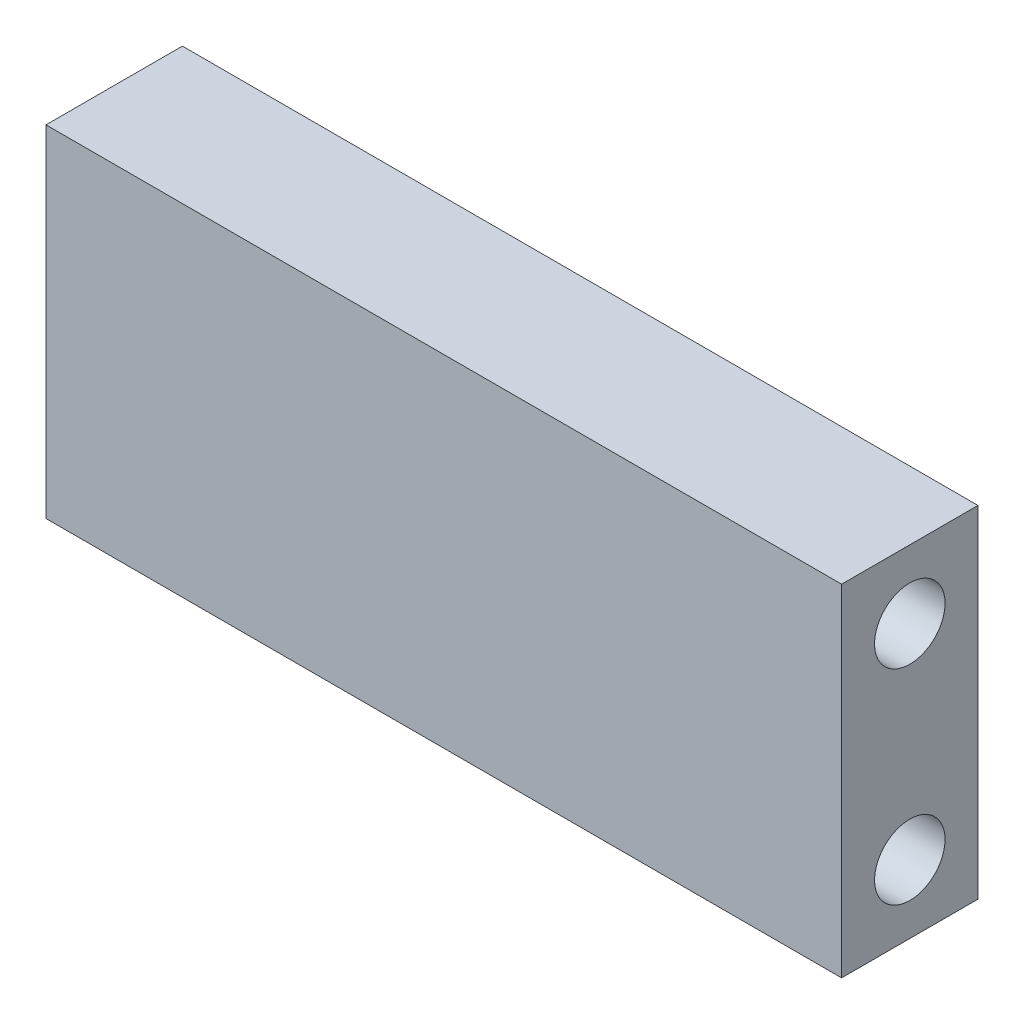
ISO-10303-21;
HEADER;
FILE_DESCRIPTION(('STEP AP214'),'2;1');
FILE_NAME('part.step','',(''),(''),'','','');
FILE_SCHEMA(('AUTOMOTIVE_DESIGN { 1 0 10303 214 1 1 1 1 }'));
ENDSEC;
DATA;
#1=APPLICATION_CONTEXT('core data for automotive mechanical design processes');
#2=APPLICATION_PROTOCOL_DEFINITION('international standard','automotive_design',2000,#1);
#3=PRODUCT_CONTEXT('',#1,'mechanical');
#4=PRODUCT('Part','Part','',(#3));
#5=PRODUCT_RELATED_PRODUCT_CATEGORY('part','',(#4));
#6=PRODUCT_DEFINITION_FORMATION('','',#4);
#7=PRODUCT_DEFINITION_CONTEXT('part definition',#1,'design');
#8=PRODUCT_DEFINITION('design','',#6,#7);
#9=PRODUCT_DEFINITION_SHAPE('','',#8);
#10=(LENGTH_UNIT() NAMED_UNIT(*) SI_UNIT(.MILLI.,.METRE.));
#11=(NAMED_UNIT(*) PLANE_ANGLE_UNIT() SI_UNIT($,.RADIAN.));
#12=(NAMED_UNIT(*) SI_UNIT($,.STERADIAN.) SOLID_ANGLE_UNIT());
#13=UNCERTAINTY_MEASURE_WITH_UNIT(LENGTH_MEASURE(1.E-05),#10,'distance_accuracy_value','');
#14=(GEOMETRIC_REPRESENTATION_CONTEXT(3) GLOBAL_UNCERTAINTY_ASSIGNED_CONTEXT((#13)) GLOBAL_UNIT_ASSIGNED_CONTEXT((#10,
#11,#12)) REPRESENTATION_CONTEXT('',''));
#15=CARTESIAN_POINT('',(0.,0.,0.));
#16=DIRECTION('',(0.,0.,1.));
#17=DIRECTION('',(1.,0.,0.));
#18=AXIS2_PLACEMENT_3D('',#15,#16,#17);
#19=CARTESIAN_POINT('',(0.,0.,0.));
#20=DIRECTION('',(0.,0.,-1.));
#21=DIRECTION('',(0.,-1.,0.));
#22=AXIS2_PLACEMENT_3D('',#19,#20,#21);
#23=PLANE('',#22);
#24=DIRECTION('',(0.,1.,0.));
#25=VECTOR('',#24,1.);
#26=CARTESIAN_POINT('',(35.,-15.,0.));
#27=LINE('',#26,#25);
#28=CARTESIAN_POINT('',(35.,-15.,0.));
#29=VERTEX_POINT('',#28);
#30=CARTESIAN_POINT('',(35.,15.,0.));
#31=VERTEX_POINT('',#30);
#32=EDGE_CURVE('E118',#29,#31,#27,.T.);
#33=ORIENTED_EDGE('',*,*,#32,.F.);
#34=DIRECTION('',(1.,0.,0.));
#35=VECTOR('',#34,1.);
#36=CARTESIAN_POINT('',(-35.,-15.,0.));
#37=LINE('',#36,#35);
#38=CARTESIAN_POINT('',(-35.,-15.,0.));
#39=VERTEX_POINT('',#38);
#40=EDGE_CURVE('E26',#39,#29,#37,.T.);
#41=ORIENTED_EDGE('',*,*,#40,.F.);
#42=DIRECTION('',(0.,-1.,0.));
#43=VECTOR('',#42,1.);
#44=CARTESIAN_POINT('',(-35.,-15.,0.));
#45=LINE('',#44,#43);
#46=CARTESIAN_POINT('',(-35.,15.,0.));
#47=VERTEX_POINT('',#46);
#48=EDGE_CURVE('E71',#47,#39,#45,.T.);
#49=ORIENTED_EDGE('',*,*,#48,.F.);
#50=DIRECTION('',(-1.,0.,0.));
#51=VECTOR('',#50,1.);
#52=CARTESIAN_POINT('',(-35.,15.,0.));
#53=LINE('',#52,#51);
#54=EDGE_CURVE('E74',#31,#47,#53,.T.);
#55=ORIENTED_EDGE('',*,*,#54,.F.);
#56=EDGE_LOOP('',(#33,#41,#49,#55));
#57=FACE_BOUND('',#56,.T.);
#58=ADVANCED_FACE('F17',(#57),#23,.T.);
#59=CARTESIAN_POINT('',(0.,0.,12.));
#60=DIRECTION('',(0.,0.,-1.));
#61=DIRECTION('',(0.,-1.,0.));
#62=AXIS2_PLACEMENT_3D('',#59,#60,#61);
#63=PLANE('',#62);
#64=DIRECTION('',(0.,1.,0.));
#65=VECTOR('',#64,1.);
#66=CARTESIAN_POINT('',(35.,-15.,12.));
#67=LINE('',#66,#65);
#68=CARTESIAN_POINT('',(35.,-15.,12.));
#69=VERTEX_POINT('',#68);
#70=CARTESIAN_POINT('',(35.,15.,12.));
#71=VERTEX_POINT('',#70);
#72=EDGE_CURVE('E102',#69,#71,#67,.T.);
#73=ORIENTED_EDGE('',*,*,#72,.T.);
#74=DIRECTION('',(-1.,0.,0.));
#75=VECTOR('',#74,1.);
#76=CARTESIAN_POINT('',(-35.,15.,12.));
#77=LINE('',#76,#75);
#78=CARTESIAN_POINT('',(-35.,15.,12.));
#79=VERTEX_POINT('',#78);
#80=EDGE_CURVE('E80',#71,#79,#77,.T.);
#81=ORIENTED_EDGE('',*,*,#80,.T.);
#82=DIRECTION('',(0.,-1.,0.));
#83=VECTOR('',#82,1.);
#84=CARTESIAN_POINT('',(-35.,-15.,12.));
#85=LINE('',#84,#83);
#86=CARTESIAN_POINT('',(-35.,-15.,12.));
#87=VERTEX_POINT('',#86);
#88=EDGE_CURVE('E85',#79,#87,#85,.T.);
#89=ORIENTED_EDGE('',*,*,#88,.T.);
#90=DIRECTION('',(1.,0.,0.));
#91=VECTOR('',#90,1.);
#92=CARTESIAN_POINT('',(-35.,-15.,12.));
#93=LINE('',#92,#91);
#94=EDGE_CURVE('E11',#87,#69,#93,.T.);
#95=ORIENTED_EDGE('',*,*,#94,.T.);
#96=EDGE_LOOP('',(#73,#81,#89,#95));
#97=FACE_BOUND('',#96,.T.);
#98=ADVANCED_FACE('F19',(#97),#63,.F.);
#99=CARTESIAN_POINT('',(-35.,-15.,12.));
#100=DIRECTION('',(0.,1.,0.));
#101=DIRECTION('',(1.,0.,0.));
#102=AXIS2_PLACEMENT_3D('',#99,#100,#101);
#103=PLANE('',#102);
#104=ORIENTED_EDGE('',*,*,#40,.T.);
#105=DIRECTION('',(0.,0.,-1.));
#106=VECTOR('',#105,1.);
#107=CARTESIAN_POINT('',(35.,-15.,12.));
#108=LINE('',#107,#106);
#109=EDGE_CURVE('E95',#69,#29,#108,.T.);
#110=ORIENTED_EDGE('',*,*,#109,.F.);
#111=ORIENTED_EDGE('',*,*,#94,.F.);
#112=DIRECTION('',(0.,0.,-1.));
#113=VECTOR('',#112,1.);
#114=CARTESIAN_POINT('',(-35.,-15.,12.));
#115=LINE('',#114,#113);
#116=EDGE_CURVE('E79',#87,#39,#115,.T.);
#117=ORIENTED_EDGE('',*,*,#116,.T.);
#118=EDGE_LOOP('',(#104,#110,#111,#117));
#119=FACE_BOUND('',#118,.T.);
#120=ADVANCED_FACE('F114',(#119),#103,.F.);
#121=CARTESIAN_POINT('',(-35.,-15.,12.));
#122=DIRECTION('',(1.,0.,0.));
#123=DIRECTION('',(0.,1.,0.));
#124=AXIS2_PLACEMENT_3D('',#121,#122,#123);
#125=PLANE('',#124);
#126=CARTESIAN_POINT('',(-35.,-9.,6.));
#127=DIRECTION('',(1.,0.,0.));
#128=DIRECTION('',(0.,0.,-1.));
#129=AXIS2_PLACEMENT_3D('',#126,#127,#128);
#130=CIRCLE('',#129,3.1);
#131=CARTESIAN_POINT('',(-35.,-9.,2.9));
#132=VERTEX_POINT('',#131);
#133=EDGE_CURVE('E129',#132,#132,#130,.T.);
#134=ORIENTED_EDGE('',*,*,#133,.T.);
#135=EDGE_LOOP('',(#134));
#136=FACE_BOUND('',#135,.T.);
#137=CARTESIAN_POINT('',(-35.,9.,6.));
#138=DIRECTION('',(1.,0.,0.));
#139=DIRECTION('',(0.,0.,-1.));
#140=AXIS2_PLACEMENT_3D('',#137,#138,#139);
#141=CIRCLE('',#140,3.1);
#142=CARTESIAN_POINT('',(-35.,9.,2.9));
#143=VERTEX_POINT('',#142);
#144=EDGE_CURVE('E138',#143,#143,#141,.T.);
#145=ORIENTED_EDGE('',*,*,#144,.T.);
#146=EDGE_LOOP('',(#145));
#147=FACE_BOUND('',#146,.T.);
#148=ORIENTED_EDGE('',*,*,#48,.T.);
#149=ORIENTED_EDGE('',*,*,#116,.F.);
#150=ORIENTED_EDGE('',*,*,#88,.F.);
#151=DIRECTION('',(0.,0.,-1.));
#152=VECTOR('',#151,1.);
#153=CARTESIAN_POINT('',(-35.,15.,12.));
#154=LINE('',#153,#152);
#155=EDGE_CURVE('E83',#79,#47,#154,.T.);
#156=ORIENTED_EDGE('',*,*,#155,.T.);
#157=EDGE_LOOP('',(#148,#149,#150,#156));
#158=FACE_BOUND('',#157,.T.);
#159=ADVANCED_FACE('F84',(#136,#147,#158),#125,.F.);
#160=CARTESIAN_POINT('',(-35.,15.,12.));
#161=DIRECTION('',(0.,-1.,0.));
#162=DIRECTION('',(0.,0.,-1.));
#163=AXIS2_PLACEMENT_3D('',#160,#161,#162);
#164=PLANE('',#163);
#165=ORIENTED_EDGE('',*,*,#54,.T.);
#166=ORIENTED_EDGE('',*,*,#155,.F.);
#167=ORIENTED_EDGE('',*,*,#80,.F.);
#168=DIRECTION('',(0.,0.,-1.));
#169=VECTOR('',#168,1.);
#170=CARTESIAN_POINT('',(35.,15.,12.));
#171=LINE('',#170,#169);
#172=EDGE_CURVE('E92',#71,#31,#171,.T.);
#173=ORIENTED_EDGE('',*,*,#172,.T.);
#174=EDGE_LOOP('',(#165,#166,#167,#173));
#175=FACE_BOUND('',#174,.T.);
#176=ADVANCED_FACE('F90',(#175),#164,.F.);
#177=CARTESIAN_POINT('',(35.,-15.,12.));
#178=DIRECTION('',(-1.,0.,0.));
#179=DIRECTION('',(0.,0.,1.));
#180=AXIS2_PLACEMENT_3D('',#177,#178,#179);
#181=PLANE('',#180);
#182=CARTESIAN_POINT('',(35.,-9.,6.));
#183=DIRECTION('',(1.,0.,0.));
#184=DIRECTION('',(0.,0.,-1.));
#185=AXIS2_PLACEMENT_3D('',#182,#183,#184);
#186=CIRCLE('',#185,3.1);
#187=CARTESIAN_POINT('',(35.,-9.,2.9));
#188=VERTEX_POINT('',#187);
#189=EDGE_CURVE('E121',#188,#188,#186,.T.);
#190=ORIENTED_EDGE('',*,*,#189,.F.);
#191=EDGE_LOOP('',(#190));
#192=FACE_BOUND('',#191,.T.);
#193=CARTESIAN_POINT('',(35.,9.,6.));
#194=DIRECTION('',(1.,0.,0.));
#195=DIRECTION('',(0.,0.,-1.));
#196=AXIS2_PLACEMENT_3D('',#193,#194,#195);
#197=CIRCLE('',#196,3.1);
#198=CARTESIAN_POINT('',(35.,9.,2.9));
#199=VERTEX_POINT('',#198);
#200=EDGE_CURVE('E136',#199,#199,#197,.T.);
#201=ORIENTED_EDGE('',*,*,#200,.F.);
#202=EDGE_LOOP('',(#201));
#203=FACE_BOUND('',#202,.T.);
#204=ORIENTED_EDGE('',*,*,#32,.T.);
#205=ORIENTED_EDGE('',*,*,#172,.F.);
#206=ORIENTED_EDGE('',*,*,#72,.F.);
#207=ORIENTED_EDGE('',*,*,#109,.T.);
#208=EDGE_LOOP('',(#204,#205,#206,#207));
#209=FACE_BOUND('',#208,.T.);
#210=ADVANCED_FACE('F117',(#192,#203,#209),#181,.F.);
#211=CARTESIAN_POINT('',(-35.,-9.,6.));
#212=DIRECTION('',(1.,0.,0.));
#213=DIRECTION('',(0.,0.,-1.));
#214=AXIS2_PLACEMENT_3D('',#211,#212,#213);
#215=CYLINDRICAL_SURFACE('',#214,3.1);
#216=ORIENTED_EDGE('',*,*,#189,.T.);
#217=EDGE_LOOP('',(#216));
#218=FACE_BOUND('',#217,.T.);
#219=ORIENTED_EDGE('',*,*,#133,.F.);
#220=EDGE_LOOP('',(#219));
#221=FACE_BOUND('',#220,.T.);
#222=ADVANCED_FACE('F152',(#218,#221),#215,.F.);
#223=CARTESIAN_POINT('',(-35.,9.,6.));
#224=DIRECTION('',(1.,0.,0.));
#225=DIRECTION('',(0.,0.,-1.));
#226=AXIS2_PLACEMENT_3D('',#223,#224,#225);
#227=CYLINDRICAL_SURFACE('',#226,3.1);
#228=ORIENTED_EDGE('',*,*,#200,.T.);
#229=EDGE_LOOP('',(#228));
#230=FACE_BOUND('',#229,.T.);
#231=ORIENTED_EDGE('',*,*,#144,.F.);
#232=EDGE_LOOP('',(#231));
#233=FACE_BOUND('',#232,.T.);
#234=ADVANCED_FACE('F148',(#230,#233),#227,.F.);
#235=CLOSED_SHELL('',(#58,#98,#120,#159,#176,#210,#222,#234));
#236=MANIFOLD_SOLID_BREP('B1',#235);
#237=ADVANCED_BREP_SHAPE_REPRESENTATION('',(#18,#236),#14);
#238=SHAPE_DEFINITION_REPRESENTATION(#9,#237);
ENDSEC;
END-ISO-10303-21;
